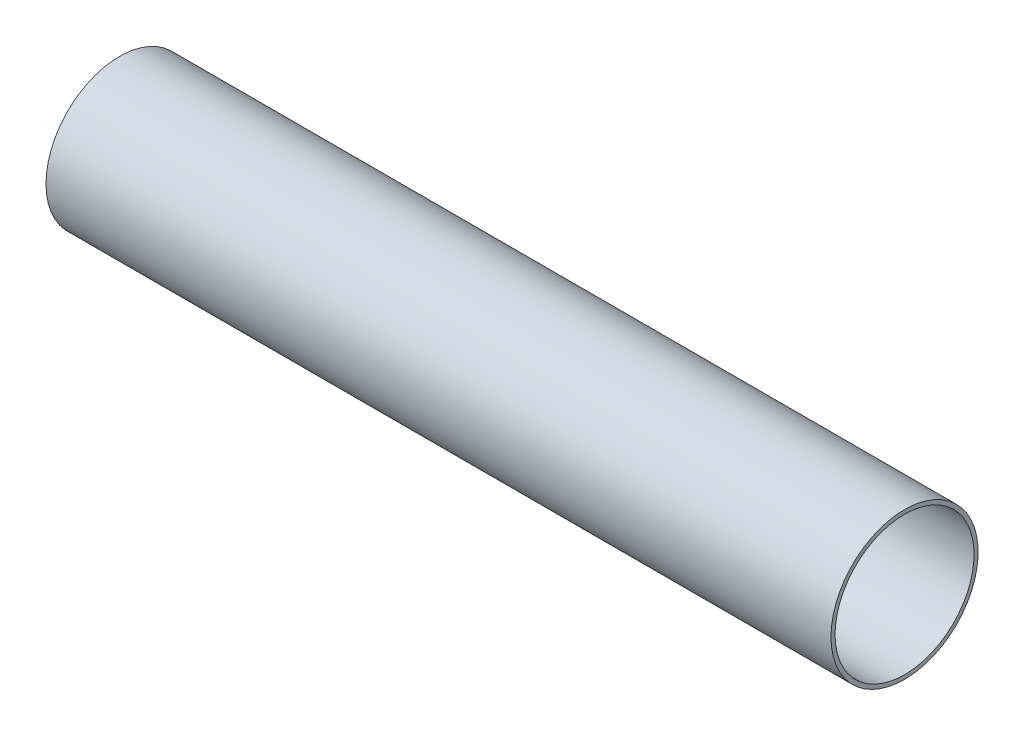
ISO-10303-21;
HEADER;
FILE_DESCRIPTION(('STEP AP214'),'2;1');
FILE_NAME('part.step','',(''),(''),'','','');
FILE_SCHEMA(('AUTOMOTIVE_DESIGN { 1 0 10303 214 1 1 1 1 }'));
ENDSEC;
DATA;
#1=APPLICATION_CONTEXT('core data for automotive mechanical design processes');
#2=APPLICATION_PROTOCOL_DEFINITION('international standard','automotive_design',2000,#1);
#3=PRODUCT_CONTEXT('',#1,'mechanical');
#4=PRODUCT('Part','Part','',(#3));
#5=PRODUCT_RELATED_PRODUCT_CATEGORY('part','',(#4));
#6=PRODUCT_DEFINITION_FORMATION('','',#4);
#7=PRODUCT_DEFINITION_CONTEXT('part definition',#1,'design');
#8=PRODUCT_DEFINITION('design','',#6,#7);
#9=PRODUCT_DEFINITION_SHAPE('','',#8);
#10=(LENGTH_UNIT() NAMED_UNIT(*) SI_UNIT(.MILLI.,.METRE.));
#11=(NAMED_UNIT(*) PLANE_ANGLE_UNIT() SI_UNIT($,.RADIAN.));
#12=(NAMED_UNIT(*) SI_UNIT($,.STERADIAN.) SOLID_ANGLE_UNIT());
#13=UNCERTAINTY_MEASURE_WITH_UNIT(LENGTH_MEASURE(1.E-05),#10,'distance_accuracy_value','');
#14=(GEOMETRIC_REPRESENTATION_CONTEXT(3) GLOBAL_UNCERTAINTY_ASSIGNED_CONTEXT((#13)) GLOBAL_UNIT_ASSIGNED_CONTEXT((#10,
#11,#12)) REPRESENTATION_CONTEXT('',''));
#15=CARTESIAN_POINT('',(0.,0.,0.));
#16=DIRECTION('',(0.,0.,1.));
#17=DIRECTION('',(1.,0.,0.));
#18=AXIS2_PLACEMENT_3D('',#15,#16,#17);
#19=CARTESIAN_POINT('',(304.8,0.,0.));
#20=DIRECTION('',(1.,0.,0.));
#21=DIRECTION('',(0.,0.,-1.));
#22=AXIS2_PLACEMENT_3D('',#19,#20,#21);
#23=PLANE('',#22);
#24=CARTESIAN_POINT('',(304.8,0.,0.));
#25=DIRECTION('',(1.,0.,0.));
#26=DIRECTION('',(0.,0.,-1.));
#27=AXIS2_PLACEMENT_3D('',#24,#25,#26);
#28=CIRCLE('',#27,28.575);
#29=CARTESIAN_POINT('',(304.8,0.,28.575));
#30=VERTEX_POINT('',#29);
#31=EDGE_CURVE('E10',#30,#30,#28,.T.);
#32=ORIENTED_EDGE('',*,*,#31,.T.);
#33=EDGE_LOOP('',(#32));
#34=FACE_BOUND('',#33,.T.);
#35=CARTESIAN_POINT('',(304.8,0.,0.));
#36=DIRECTION('',(1.,0.,0.));
#37=DIRECTION('',(0.,0.,-1.));
#38=AXIS2_PLACEMENT_3D('',#35,#36,#37);
#39=CIRCLE('',#38,26.9875);
#40=CARTESIAN_POINT('',(304.8,0.,26.9875));
#41=VERTEX_POINT('',#40);
#42=EDGE_CURVE('E40',#41,#41,#39,.T.);
#43=ORIENTED_EDGE('',*,*,#42,.F.);
#44=EDGE_LOOP('',(#43));
#45=FACE_BOUND('',#44,.T.);
#46=ADVANCED_FACE('F29',(#34,#45),#23,.T.);
#47=CARTESIAN_POINT('',(0.,0.,0.));
#48=DIRECTION('',(1.,0.,0.));
#49=DIRECTION('',(0.,0.,-1.));
#50=AXIS2_PLACEMENT_3D('',#47,#48,#49);
#51=PLANE('',#50);
#52=CARTESIAN_POINT('',(0.,0.,0.));
#53=DIRECTION('',(1.,0.,0.));
#54=DIRECTION('',(0.,0.,-1.));
#55=AXIS2_PLACEMENT_3D('',#52,#53,#54);
#56=CIRCLE('',#55,28.575);
#57=CARTESIAN_POINT('',(0.,0.,28.575));
#58=VERTEX_POINT('',#57);
#59=EDGE_CURVE('E36',#58,#58,#56,.T.);
#60=ORIENTED_EDGE('',*,*,#59,.F.);
#61=EDGE_LOOP('',(#60));
#62=FACE_BOUND('',#61,.T.);
#63=CARTESIAN_POINT('',(0.,0.,0.));
#64=DIRECTION('',(1.,0.,0.));
#65=DIRECTION('',(0.,0.,-1.));
#66=AXIS2_PLACEMENT_3D('',#63,#64,#65);
#67=CIRCLE('',#66,26.9875);
#68=CARTESIAN_POINT('',(0.,0.,26.9875));
#69=VERTEX_POINT('',#68);
#70=EDGE_CURVE('E44',#69,#69,#67,.T.);
#71=ORIENTED_EDGE('',*,*,#70,.T.);
#72=EDGE_LOOP('',(#71));
#73=FACE_BOUND('',#72,.T.);
#74=ADVANCED_FACE('F50',(#62,#73),#51,.F.);
#75=CARTESIAN_POINT('',(304.8,0.,0.));
#76=DIRECTION('',(-1.,0.,0.));
#77=DIRECTION('',(0.,0.,1.));
#78=AXIS2_PLACEMENT_3D('',#75,#76,#77);
#79=CYLINDRICAL_SURFACE('',#78,28.575);
#80=CARTESIAN_POINT('',(304.8,0.,28.575));
#81=CARTESIAN_POINT('',(301.625,0.,28.575));
#82=CARTESIAN_POINT('',(298.45,0.,28.575));
#83=CARTESIAN_POINT('',(292.1,0.,28.575));
#84=CARTESIAN_POINT('',(288.925,0.,28.575));
#85=CARTESIAN_POINT('',(282.575,0.,28.575));
#86=CARTESIAN_POINT('',(279.4,0.,28.575));
#87=CARTESIAN_POINT('',(273.05,0.,28.575));
#88=CARTESIAN_POINT('',(269.875,0.,28.575));
#89=CARTESIAN_POINT('',(263.525,0.,28.575));
#90=CARTESIAN_POINT('',(260.35,0.,28.575));
#91=CARTESIAN_POINT('',(254.,0.,28.575));
#92=CARTESIAN_POINT('',(250.825,0.,28.575));
#93=CARTESIAN_POINT('',(244.475,0.,28.575));
#94=CARTESIAN_POINT('',(241.3,0.,28.575));
#95=CARTESIAN_POINT('',(234.95,0.,28.575));
#96=CARTESIAN_POINT('',(231.775,0.,28.575));
#97=CARTESIAN_POINT('',(225.425,0.,28.575));
#98=CARTESIAN_POINT('',(222.25,0.,28.575));
#99=CARTESIAN_POINT('',(215.9,0.,28.575));
#100=CARTESIAN_POINT('',(212.725,0.,28.575));
#101=CARTESIAN_POINT('',(206.375,0.,28.575));
#102=CARTESIAN_POINT('',(203.2,0.,28.575));
#103=CARTESIAN_POINT('',(196.85,0.,28.575));
#104=CARTESIAN_POINT('',(193.675,0.,28.575));
#105=CARTESIAN_POINT('',(187.325,0.,28.575));
#106=CARTESIAN_POINT('',(184.15,0.,28.575));
#107=CARTESIAN_POINT('',(177.8,0.,28.575));
#108=CARTESIAN_POINT('',(174.625,0.,28.575));
#109=CARTESIAN_POINT('',(168.275,0.,28.575));
#110=CARTESIAN_POINT('',(165.1,0.,28.575));
#111=CARTESIAN_POINT('',(158.75,0.,28.575));
#112=CARTESIAN_POINT('',(155.575,0.,28.575));
#113=CARTESIAN_POINT('',(149.225,0.,28.575));
#114=CARTESIAN_POINT('',(146.05,0.,28.575));
#115=CARTESIAN_POINT('',(139.7,0.,28.575));
#116=CARTESIAN_POINT('',(136.525,0.,28.575));
#117=CARTESIAN_POINT('',(130.175,0.,28.575));
#118=CARTESIAN_POINT('',(127.,0.,28.575));
#119=CARTESIAN_POINT('',(120.65,0.,28.575));
#120=CARTESIAN_POINT('',(117.475,0.,28.575));
#121=CARTESIAN_POINT('',(111.125,0.,28.575));
#122=CARTESIAN_POINT('',(107.95,0.,28.575));
#123=CARTESIAN_POINT('',(101.6,0.,28.575));
#124=CARTESIAN_POINT('',(98.425,0.,28.575));
#125=CARTESIAN_POINT('',(92.075,0.,28.575));
#126=CARTESIAN_POINT('',(88.9,0.,28.575));
#127=CARTESIAN_POINT('',(82.55,0.,28.575));
#128=CARTESIAN_POINT('',(79.375,0.,28.575));
#129=CARTESIAN_POINT('',(73.025,0.,28.575));
#130=CARTESIAN_POINT('',(69.85,0.,28.575));
#131=CARTESIAN_POINT('',(63.5,0.,28.575));
#132=CARTESIAN_POINT('',(60.325,0.,28.575));
#133=CARTESIAN_POINT('',(53.975,0.,28.575));
#134=CARTESIAN_POINT('',(50.8,0.,28.575));
#135=CARTESIAN_POINT('',(44.45,0.,28.575));
#136=CARTESIAN_POINT('',(41.275,0.,28.575));
#137=CARTESIAN_POINT('',(34.925,0.,28.575));
#138=CARTESIAN_POINT('',(31.75,0.,28.575));
#139=CARTESIAN_POINT('',(25.4,0.,28.575));
#140=CARTESIAN_POINT('',(22.225,0.,28.575));
#141=CARTESIAN_POINT('',(15.875,0.,28.575));
#142=CARTESIAN_POINT('',(12.7,0.,28.575));
#143=CARTESIAN_POINT('',(6.35,0.,28.575));
#144=CARTESIAN_POINT('',(3.175,0.,28.575));
#145=CARTESIAN_POINT('',(0.,0.,28.575));
#146=B_SPLINE_CURVE_WITH_KNOTS('',3,(#80,#81,#82,#83,#84,#85,#86,#87,#88,#89,#90,#91,#92,#93,
#94,#95,#96,#97,#98,#99,#100,#101,#102,#103,#104,#105,#106,#107,#108,#109,#110,#111,#112,#113,
#114,#115,#116,#117,#118,#119,#120,#121,#122,#123,#124,#125,#126,#127,#128,#129,#130,#131,#132,
#133,#134,#135,#136,#137,#138,#139,#140,#141,#142,#143,#144,#145),.UNSPECIFIED.,.F.,.F.,(4,2,2,
2,2,2,2,2,2,2,2,2,2,2,2,2,2,2,2,2,2,2,2,2,2,2,2,2,2,2,2,2,4),(0.,9.52499999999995,19.05,28.575,
38.1,47.625,57.15,66.675,76.2,85.725,95.2499999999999,104.775,114.3,123.825,133.35,142.875,
152.4,161.925,171.45,180.975,190.5,200.025,209.55,219.075,228.6,238.125,247.65,257.175,266.7,
276.225,285.75,295.275,304.8),.UNSPECIFIED.);
#147=EDGE_CURVE('BSEAM31',#30,#58,#146,.T.);
#148=ORIENTED_EDGE('',*,*,#31,.F.);
#149=ORIENTED_EDGE('',*,*,#59,.T.);
#150=ORIENTED_EDGE('',*,*,#147,.T.);
#151=ORIENTED_EDGE('',*,*,#147,.F.);
#152=EDGE_LOOP('',(#148,#150,#149,#151));
#153=FACE_BOUND('',#152,.T.);
#154=ADVANCED_FACE('F31',(#153),#79,.T.);
#155=CARTESIAN_POINT('',(304.8,0.,0.));
#156=DIRECTION('',(-1.,0.,0.));
#157=DIRECTION('',(0.,0.,1.));
#158=AXIS2_PLACEMENT_3D('',#155,#156,#157);
#159=CYLINDRICAL_SURFACE('',#158,26.9875);
#160=CARTESIAN_POINT('',(304.8,0.,26.9875));
#161=CARTESIAN_POINT('',(301.625,0.,26.9875));
#162=CARTESIAN_POINT('',(298.45,0.,26.9875));
#163=CARTESIAN_POINT('',(292.1,0.,26.9875));
#164=CARTESIAN_POINT('',(288.925,0.,26.9875));
#165=CARTESIAN_POINT('',(282.575,0.,26.9875));
#166=CARTESIAN_POINT('',(279.4,0.,26.9875));
#167=CARTESIAN_POINT('',(273.05,0.,26.9875));
#168=CARTESIAN_POINT('',(269.875,0.,26.9875));
#169=CARTESIAN_POINT('',(263.525,0.,26.9875));
#170=CARTESIAN_POINT('',(260.35,0.,26.9875));
#171=CARTESIAN_POINT('',(254.,0.,26.9875));
#172=CARTESIAN_POINT('',(250.825,0.,26.9875));
#173=CARTESIAN_POINT('',(244.475,0.,26.9875));
#174=CARTESIAN_POINT('',(241.3,0.,26.9875));
#175=CARTESIAN_POINT('',(234.95,0.,26.9875));
#176=CARTESIAN_POINT('',(231.775,0.,26.9875));
#177=CARTESIAN_POINT('',(225.425,0.,26.9875));
#178=CARTESIAN_POINT('',(222.25,0.,26.9875));
#179=CARTESIAN_POINT('',(215.9,0.,26.9875));
#180=CARTESIAN_POINT('',(212.725,0.,26.9875));
#181=CARTESIAN_POINT('',(206.375,0.,26.9875));
#182=CARTESIAN_POINT('',(203.2,0.,26.9875));
#183=CARTESIAN_POINT('',(196.85,0.,26.9875));
#184=CARTESIAN_POINT('',(193.675,0.,26.9875));
#185=CARTESIAN_POINT('',(187.325,0.,26.9875));
#186=CARTESIAN_POINT('',(184.15,0.,26.9875));
#187=CARTESIAN_POINT('',(177.8,0.,26.9875));
#188=CARTESIAN_POINT('',(174.625,0.,26.9875));
#189=CARTESIAN_POINT('',(168.275,0.,26.9875));
#190=CARTESIAN_POINT('',(165.1,0.,26.9875));
#191=CARTESIAN_POINT('',(158.75,0.,26.9875));
#192=CARTESIAN_POINT('',(155.575,0.,26.9875));
#193=CARTESIAN_POINT('',(149.225,0.,26.9875));
#194=CARTESIAN_POINT('',(146.05,0.,26.9875));
#195=CARTESIAN_POINT('',(139.7,0.,26.9875));
#196=CARTESIAN_POINT('',(136.525,0.,26.9875));
#197=CARTESIAN_POINT('',(130.175,0.,26.9875));
#198=CARTESIAN_POINT('',(127.,0.,26.9875));
#199=CARTESIAN_POINT('',(120.65,0.,26.9875));
#200=CARTESIAN_POINT('',(117.475,0.,26.9875));
#201=CARTESIAN_POINT('',(111.125,0.,26.9875));
#202=CARTESIAN_POINT('',(107.95,0.,26.9875));
#203=CARTESIAN_POINT('',(101.6,0.,26.9875));
#204=CARTESIAN_POINT('',(98.425,0.,26.9875));
#205=CARTESIAN_POINT('',(92.075,0.,26.9875));
#206=CARTESIAN_POINT('',(88.9,0.,26.9875));
#207=CARTESIAN_POINT('',(82.55,0.,26.9875));
#208=CARTESIAN_POINT('',(79.375,0.,26.9875));
#209=CARTESIAN_POINT('',(73.025,0.,26.9875));
#210=CARTESIAN_POINT('',(69.85,0.,26.9875));
#211=CARTESIAN_POINT('',(63.5,0.,26.9875));
#212=CARTESIAN_POINT('',(60.325,0.,26.9875));
#213=CARTESIAN_POINT('',(53.975,0.,26.9875));
#214=CARTESIAN_POINT('',(50.8,0.,26.9875));
#215=CARTESIAN_POINT('',(44.45,0.,26.9875));
#216=CARTESIAN_POINT('',(41.275,0.,26.9875));
#217=CARTESIAN_POINT('',(34.925,0.,26.9875));
#218=CARTESIAN_POINT('',(31.75,0.,26.9875));
#219=CARTESIAN_POINT('',(25.4,0.,26.9875));
#220=CARTESIAN_POINT('',(22.225,0.,26.9875));
#221=CARTESIAN_POINT('',(15.875,0.,26.9875));
#222=CARTESIAN_POINT('',(12.7,0.,26.9875));
#223=CARTESIAN_POINT('',(6.35,0.,26.9875));
#224=CARTESIAN_POINT('',(3.175,0.,26.9875));
#225=CARTESIAN_POINT('',(0.,0.,26.9875));
#226=B_SPLINE_CURVE_WITH_KNOTS('',3,(#160,#161,#162,#163,#164,#165,#166,#167,#168,#169,#170,
#171,#172,#173,#174,#175,#176,#177,#178,#179,#180,#181,#182,#183,#184,#185,#186,#187,#188,#189,
#190,#191,#192,#193,#194,#195,#196,#197,#198,#199,#200,#201,#202,#203,#204,#205,#206,#207,#208,
#209,#210,#211,#212,#213,#214,#215,#216,#217,#218,#219,#220,#221,#222,#223,#224,#225),
.UNSPECIFIED.,.F.,.F.,(4,2,2,2,2,2,2,2,2,2,2,2,2,2,2,2,2,2,2,2,2,2,2,2,2,2,2,2,2,2,2,2,4),(0.,
9.52500000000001,19.05,28.575,38.1,47.625,57.15,66.675,76.2,85.7250000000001,95.2500000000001,
104.775,114.3,123.825,133.35,142.875,152.4,161.925,171.45,180.975,190.5,200.025,209.55,219.075,
228.6,238.125,247.65,257.175,266.7,276.225,285.75,295.275,304.8),.UNSPECIFIED.);
#227=EDGE_CURVE('BSEAM52',#41,#69,#226,.T.);
#228=ORIENTED_EDGE('',*,*,#42,.T.);
#229=ORIENTED_EDGE('',*,*,#70,.F.);
#230=ORIENTED_EDGE('',*,*,#227,.T.);
#231=ORIENTED_EDGE('',*,*,#227,.F.);
#232=EDGE_LOOP('',(#228,#230,#229,#231));
#233=FACE_BOUND('',#232,.T.);
#234=ADVANCED_FACE('F52',(#233),#159,.F.);
#235=CLOSED_SHELL('',(#46,#74,#154,#234));
#236=MANIFOLD_SOLID_BREP('B2',#235);
#237=ADVANCED_BREP_SHAPE_REPRESENTATION('',(#18,#236),#14);
#238=SHAPE_DEFINITION_REPRESENTATION(#9,#237);
ENDSEC;
END-ISO-10303-21;
